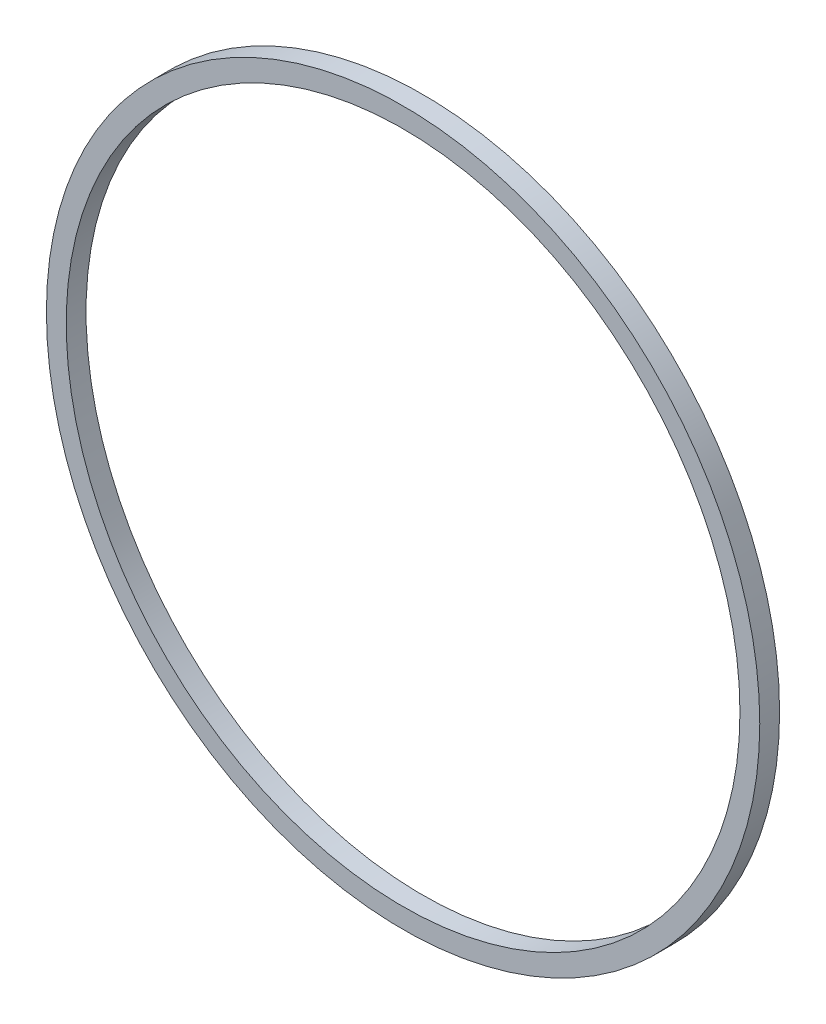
ISO-10303-21;
HEADER;
FILE_DESCRIPTION(('STEP AP214'),'2;1');
FILE_NAME('part.step','',(''),(''),'','','');
FILE_SCHEMA(('AUTOMOTIVE_DESIGN { 1 0 10303 214 1 1 1 1 }'));
ENDSEC;
DATA;
#1=APPLICATION_CONTEXT('core data for automotive mechanical design processes');
#2=APPLICATION_PROTOCOL_DEFINITION('international standard','automotive_design',2000,#1);
#3=PRODUCT_CONTEXT('',#1,'mechanical');
#4=PRODUCT('Part','Part','',(#3));
#5=PRODUCT_RELATED_PRODUCT_CATEGORY('part','',(#4));
#6=PRODUCT_DEFINITION_FORMATION('','',#4);
#7=PRODUCT_DEFINITION_CONTEXT('part definition',#1,'design');
#8=PRODUCT_DEFINITION('design','',#6,#7);
#9=PRODUCT_DEFINITION_SHAPE('','',#8);
#10=(LENGTH_UNIT() NAMED_UNIT(*) SI_UNIT(.MILLI.,.METRE.));
#11=(NAMED_UNIT(*) PLANE_ANGLE_UNIT() SI_UNIT($,.RADIAN.));
#12=(NAMED_UNIT(*) SI_UNIT($,.STERADIAN.) SOLID_ANGLE_UNIT());
#13=UNCERTAINTY_MEASURE_WITH_UNIT(LENGTH_MEASURE(1.E-05),#10,'distance_accuracy_value','');
#14=(GEOMETRIC_REPRESENTATION_CONTEXT(3) GLOBAL_UNCERTAINTY_ASSIGNED_CONTEXT((#13)) GLOBAL_UNIT_ASSIGNED_CONTEXT((#10,
#11,#12)) REPRESENTATION_CONTEXT('',''));
#15=CARTESIAN_POINT('',(0.,0.,0.));
#16=DIRECTION('',(0.,0.,1.));
#17=DIRECTION('',(1.,0.,0.));
#18=AXIS2_PLACEMENT_3D('',#15,#16,#17);
#19=CARTESIAN_POINT('',(0.,36.,2.));
#20=DIRECTION('',(0.,0.,-1.));
#21=DIRECTION('',(-1.,0.,0.));
#22=AXIS2_PLACEMENT_3D('',#19,#20,#21);
#23=PLANE('',#22);
#24=CARTESIAN_POINT('',(0.,0.,2.));
#25=DIRECTION('',(0.,0.,1.));
#26=DIRECTION('',(1.,0.,0.));
#27=AXIS2_PLACEMENT_3D('',#24,#25,#26);
#28=CIRCLE('',#27,34.);
#29=CARTESIAN_POINT('',(34.,0.,2.));
#30=VERTEX_POINT('',#29);
#31=EDGE_CURVE('E10',#30,#30,#28,.T.);
#32=ORIENTED_EDGE('',*,*,#31,.F.);
#33=EDGE_LOOP('',(#32));
#34=FACE_BOUND('',#33,.T.);
#35=CARTESIAN_POINT('',(0.,0.,2.));
#36=DIRECTION('',(0.,0.,1.));
#37=DIRECTION('',(1.,0.,0.));
#38=AXIS2_PLACEMENT_3D('',#35,#36,#37);
#39=CIRCLE('',#38,36.);
#40=CARTESIAN_POINT('',(36.,0.,2.));
#41=VERTEX_POINT('',#40);
#42=EDGE_CURVE('E45',#41,#41,#39,.T.);
#43=ORIENTED_EDGE('',*,*,#42,.T.);
#44=EDGE_LOOP('',(#43));
#45=FACE_BOUND('',#44,.T.);
#46=ADVANCED_FACE('F31',(#34,#45),#23,.F.);
#47=CARTESIAN_POINT('',(0.,0.,2.46520239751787));
#48=DIRECTION('',(0.,0.,1.));
#49=DIRECTION('',(1.,0.,0.));
#50=AXIS2_PLACEMENT_3D('',#47,#48,#49);
#51=CYLINDRICAL_SURFACE('',#50,34.);
#52=CARTESIAN_POINT('',(0.,0.,0.));
#53=DIRECTION('',(0.,0.,1.));
#54=DIRECTION('',(1.,0.,0.));
#55=AXIS2_PLACEMENT_3D('',#52,#53,#54);
#56=CIRCLE('',#55,34.);
#57=CARTESIAN_POINT('',(34.,0.,0.));
#58=VERTEX_POINT('',#57);
#59=EDGE_CURVE('E37',#58,#58,#56,.T.);
#60=ORIENTED_EDGE('',*,*,#59,.F.);
#61=EDGE_LOOP('',(#60));
#62=FACE_BOUND('',#61,.T.);
#63=ORIENTED_EDGE('',*,*,#31,.T.);
#64=EDGE_LOOP('',(#63));
#65=FACE_BOUND('',#64,.T.);
#66=ADVANCED_FACE('F60',(#62,#65),#51,.F.);
#67=CARTESIAN_POINT('',(0.,34.,0.));
#68=DIRECTION('',(0.,0.,1.));
#69=DIRECTION('',(1.,0.,0.));
#70=AXIS2_PLACEMENT_3D('',#67,#68,#69);
#71=PLANE('',#70);
#72=CARTESIAN_POINT('',(0.,0.,0.));
#73=DIRECTION('',(0.,0.,1.));
#74=DIRECTION('',(1.,0.,0.));
#75=AXIS2_PLACEMENT_3D('',#72,#73,#74);
#76=CIRCLE('',#75,36.);
#77=CARTESIAN_POINT('',(36.,0.,0.));
#78=VERTEX_POINT('',#77);
#79=EDGE_CURVE('E41',#78,#78,#76,.T.);
#80=ORIENTED_EDGE('',*,*,#79,.F.);
#81=EDGE_LOOP('',(#80));
#82=FACE_BOUND('',#81,.T.);
#83=ORIENTED_EDGE('',*,*,#59,.T.);
#84=EDGE_LOOP('',(#83));
#85=FACE_BOUND('',#84,.T.);
#86=ADVANCED_FACE('F55',(#82,#85),#71,.F.);
#87=CARTESIAN_POINT('',(0.,0.,2.46520239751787));
#88=DIRECTION('',(0.,0.,1.));
#89=DIRECTION('',(1.,0.,0.));
#90=AXIS2_PLACEMENT_3D('',#87,#88,#89);
#91=CYLINDRICAL_SURFACE('',#90,36.);
#92=ORIENTED_EDGE('',*,*,#42,.F.);
#93=EDGE_LOOP('',(#92));
#94=FACE_BOUND('',#93,.T.);
#95=ORIENTED_EDGE('',*,*,#79,.T.);
#96=EDGE_LOOP('',(#95));
#97=FACE_BOUND('',#96,.T.);
#98=ADVANCED_FACE('F52',(#94,#97),#91,.T.);
#99=CLOSED_SHELL('',(#46,#66,#86,#98));
#100=MANIFOLD_SOLID_BREP('B2',#99);
#101=ADVANCED_BREP_SHAPE_REPRESENTATION('',(#18,#100),#14);
#102=SHAPE_DEFINITION_REPRESENTATION(#9,#101);
ENDSEC;
END-ISO-10303-21;
